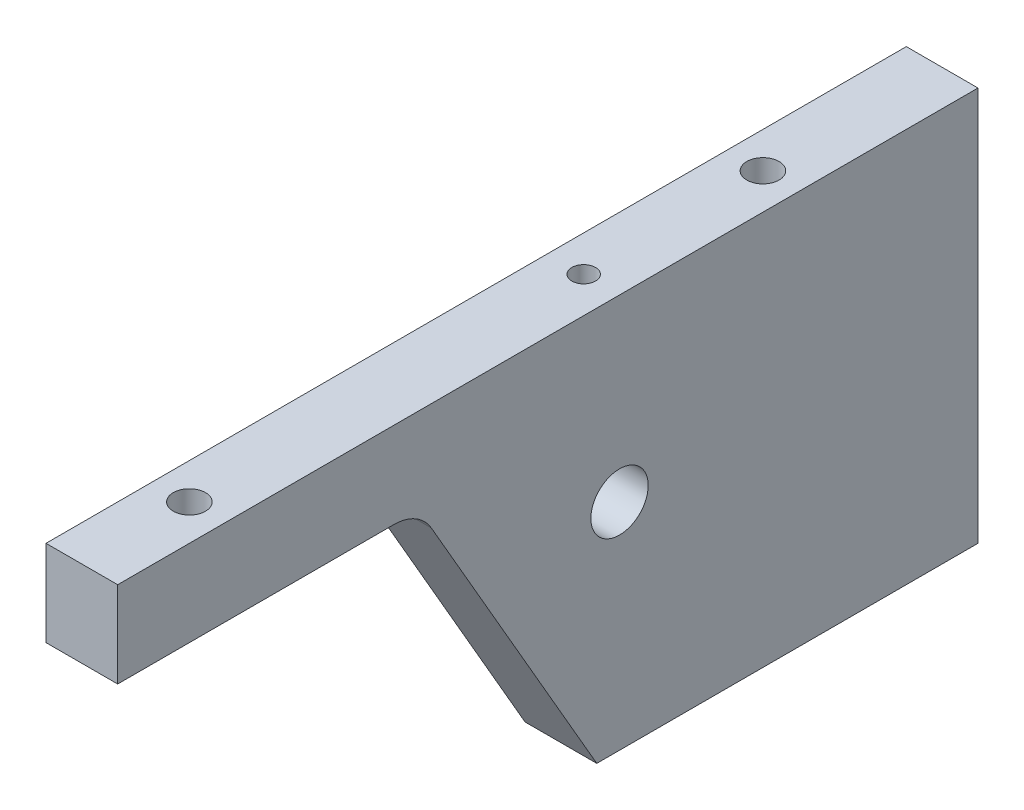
from build123d import *

# Parameters (mm, degrees)
BOSS_EXTRUDE1_DEPTH            = 5
M4X0_7_TAPPED_HOLE4_D          = 3.3
M4X0_7_TAPPED_HOLE4_DEPTH      = 10.1
M4X0_7_TAPPED_HOLE4_TIP        = 0.991420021
FILLET1_R                      = 6
SKETCH8_R                      = 4
CUT_EXTRUDE1_DEPTH             = 10
M4X0_7_TAPPED_HOLE3_REACH      = 134.098
M4X0_7_TAPPED_HOLE3_BORE_R     = 1.65
CBORE_FOR_M4_SHCS1_D           = 4.5
CBORE_FOR_M4_SHCS1_CBORE_D     = 8
CBORE_FOR_M4_SHCS1_CBORE_DEPTH = 30
CBORE_FOR_M4_SHCS2_D           = 4.5
CBORE_FOR_M4_SHCS2_CBORE_D     = 8
CBORE_FOR_M4_SHCS2_CBORE_DEPTH = 4


with BuildPart() as part:
    # Sketch1 → Boss-Extrude1 (new, symmetric)
    with BuildSketch(Plane(origin=(0, 0, 0), x_dir=(0, 0, -1), z_dir=(1, 0, 0))):
        Polygon((0, 0), (0, -55), (-53.173938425, -55), (-78, -12), (-120, -12), (-120, 0), align=None)
    extrude(amount=BOSS_EXTRUDE1_DEPTH, both=True)

    # M4x0.7 Tapped Hole4
    with Locations(Plane(origin=(0, 0, 0), x_dir=(-1, 0, 0), z_dir=(0, 0, -1))):
        with Locations((0, -10), (0, -27.5), (0, -45)):
            Hole(M4X0_7_TAPPED_HOLE4_D / 2, depth=M4X0_7_TAPPED_HOLE4_DEPTH)
            with Locations((0, 0, -(M4X0_7_TAPPED_HOLE4_DEPTH + M4X0_7_TAPPED_HOLE4_TIP / 2))):  # 118° drill point
                Cone(0, M4X0_7_TAPPED_HOLE4_D / 2, M4X0_7_TAPPED_HOLE4_TIP, mode=Mode.SUBTRACT)

    # Fillet1
    fillet1_edges = [part.edges().sort_by_distance(p)[0] for p in [
        (0, -12, 78),
    ]]
    fillet(fillet1_edges, radius=FILLET1_R)

    # Sketch8 → Cut-Extrude1 (cut)
    with BuildSketch(Plane(origin=(5, 0, 0), x_dir=(0, 0, -1), z_dir=(1, 0, 0))):
        with Locations((-50, -25)):
            Circle(SKETCH8_R)
    extrude(amount=-CUT_EXTRUDE1_DEPTH, mode=Mode.SUBTRACT)

    # M4x0.7 Tapped Hole3 bore → M4x0.7 Tapped Hole3 (cut, up to next)
    with BuildSketch(Plane(origin=(0, 0, 0), x_dir=(1, 0, 0), z_dir=(0, 1, 0)), mode=Mode.PRIVATE) as m4x0_7_tapped_hole3_sk1:
        with Locations((0, -50)):
            Circle(M4X0_7_TAPPED_HOLE3_BORE_R)
    m4x0_7_tapped_hole3_tool1 = extrude(m4x0_7_tapped_hole3_sk1.sketch, amount=-M4X0_7_TAPPED_HOLE3_REACH, mode=Mode.PRIVATE) & part.part
    add(m4x0_7_tapped_hole3_tool1.solids().sort_by_distance((0, 0, 50))[0], mode=Mode.SUBTRACT)

    # CBORE for M4 SHCS1 (through all)
    with Locations(Plane(origin=(0, -55, 0), x_dir=(-1, 0, 0), z_dir=(0, -1, 0))):
        with Locations((0, -25)):
            CounterBoreHole(CBORE_FOR_M4_SHCS1_D / 2, CBORE_FOR_M4_SHCS1_CBORE_D / 2, CBORE_FOR_M4_SHCS1_CBORE_DEPTH)

    # CBORE for M4 SHCS2 (through all)
    with Locations(Plane(origin=(0, -12, 0), x_dir=(-1, 0, 0), z_dir=(0, -1, 0))):
        with Locations((0, -105)):
            CounterBoreHole(CBORE_FOR_M4_SHCS2_D / 2, CBORE_FOR_M4_SHCS2_CBORE_D / 2, CBORE_FOR_M4_SHCS2_CBORE_DEPTH)


solid = part.part
